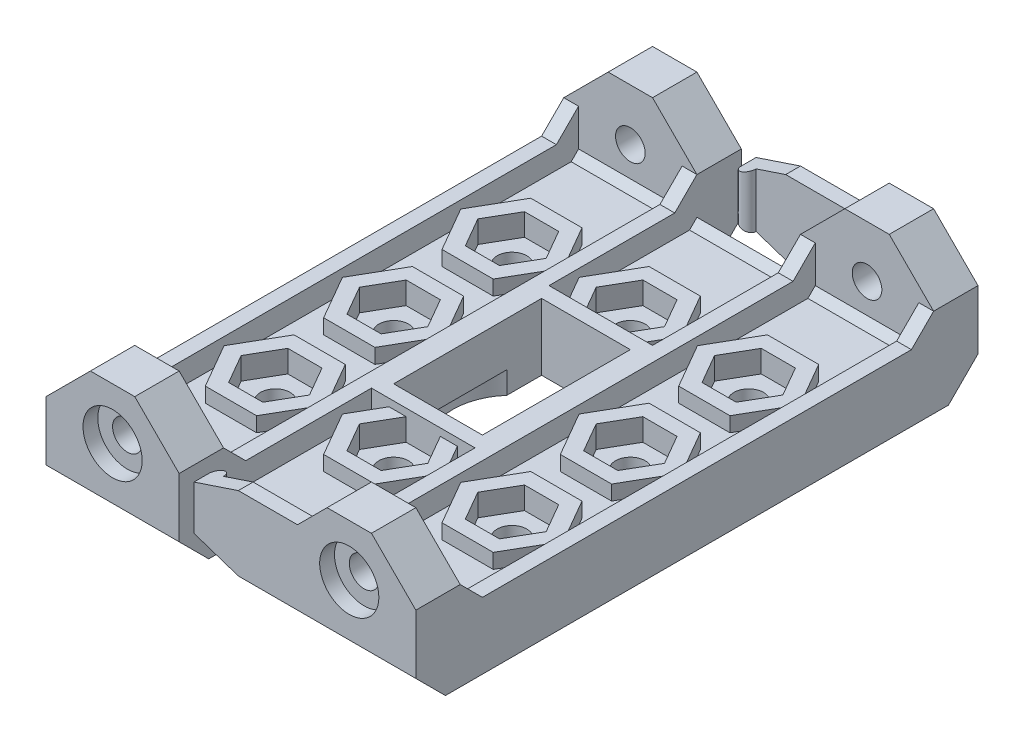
from build123d import *

# Parameters (mm, degrees)
SKETCH1_R                = 1.5
SKETCH1_R_2              = 1
SKETCH1_W                = 6
SKETCH1_H                = 10
EXTRUDE1_DEPTH           = 3
EXTRUDE2_DEPTH           = 4
EXTRUDE3_DEPTH           = 4
SKETCH7_W                = 1
SKETCH7_H                = 38
SKETCH7_W_2              = 6
SKETCH7_H_2              = 10
EXTRUDE4_DEPTH           = 4.5
EXTRUDE5_DEPTH           = 6
SKETCH9_R                = 5.5
SKETCH9_R_2              = 1.5
EXTRUDE10_DEPTH          = 3.5
EXTRUDE11_DEPTH          = 6
EXTRUDE12_DEPTH          = 4
CUT_EXTRUDE1_DEPTH       = 4
CUT_EXTRUDE2_DEPTH       = 4
SKETCH16_R               = 1
EXTRUDE13_DEPTH          = 3
CUT_EXTRUDE4_DEPTH       = 3
CUT_EXTRUDE5_DEPTH       = 32.906112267
CUT_EXTRUDE6_DEPTH       = 2
EXTRUDE14_DEPTH          = 25
EXTRUDE15_DEPTH          = 1
EXTRUDE17_DEPTH          = 1
EXTRUDE18_DEPTH          = 1
EXTRUDE19_DEPTH          = 1
CUT_EXTRUDE7_DEPTH       = 43.121847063
SKETCH26_R               = 2
CUT_EXTRUDE8_DEPTH       = 1
SKETCH27_R               = 4
CUT_EXTRUDE9_DEPTH       = 1.5
SKETCH28_R               = 4
CUT_EXTRUDE10_DEPTH      = 1
CUT_EXTRUDE11_DEPTH      = 1.5
FILLET4_R                = 0.25
CUT_EXTRUDE12_DEPTH      = 1.5
SKETCH31_W               = 16.002833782
SKETCH31_H               = 38
CUT_EXTRUDE13_DEPTH      = 32.906112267
CUT_EXTRUDE14_DEPTH      = 14.5
CUT_EXTRUDE14_DEPTH_BACK = 14.5
EXTRUDE20_DEPTH          = 15
EXTRUDE20_DEPTH_BACK     = 15
EXTRUDE21_DEPTH          = 1
CUT_EXTRUDE15_DEPTH      = 0.5
SKETCH36_R               = 1
CUT_EXTRUDE16_DEPTH      = 10.5


with BuildPart() as part:
    # Sketch1 → Extrude1 (new body)
    with BuildSketch(Plane(origin=(0, 0, 0), x_dir=(1, 0, 0), z_dir=(0, 1, 0))):
        with BuildLine():
            Line((-12.5, -19), (-12.5, -12.75))
            ThreePointArc((-12.5, -12.75), (-13.085786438, -11.335786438), (-14.5, -10.75))
            Line((-14.5, -10.75), (-19, -10.75))
            ThreePointArc((-19, -10.75), (-22.535533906, -9.285533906), (-24, -5.75))
            Line((-24, -5.75), (-24, 5.75))
            ThreePointArc((-24, 5.75), (-22.535533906, 9.285533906), (-19, 10.75))
            Line((-19, 10.75), (-14.5, 10.75))
            ThreePointArc((-14.5, 10.75), (-13.085786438, 11.335786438), (-12.5, 12.75))
            Line((-12.5, 12.75), (-12.5, 19))
            Line((-12.5, 19), (12.5, 19))
            Line((12.5, 19), (12.5, -19))
            Line((12.5, -19), (-12.5, -19))
        make_face()
        with Locations(Location((-14.5, 0, 0), (0, 0, 270))):
            Circle(SKETCH1_R, mode=Mode.SUBTRACT)
        with Locations(Location((0, 8, 0), (0, 0, 270))):
            Circle(SKETCH1_R_2, mode=Mode.SUBTRACT)
        with Locations(Location((8, 0, 0), (0, 0, 270))):
            Circle(SKETCH1_R_2, mode=Mode.SUBTRACT)
        with Locations(Location((0, -8, 0), (0, 0, 270))):
            Circle(SKETCH1_R_2, mode=Mode.SUBTRACT)
        with Locations(Location((-8, 0, 0), (0, 0, 270))):
            Circle(SKETCH1_R_2, mode=Mode.SUBTRACT)
        with Locations(Location((-20.156854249, 5.656854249, 0), (0, 0, 270))):
            Circle(SKETCH1_R_2, mode=Mode.SUBTRACT)
        with Locations(Location((-20.156854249, -5.656854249, 0), (0, 0, 270))):
            Circle(SKETCH1_R_2, mode=Mode.SUBTRACT)
        with Locations(Location((-8.843145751, -5.656854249, 0), (0, 0, 270))):
            Circle(SKETCH1_R_2, mode=Mode.SUBTRACT)
        with Locations(Location((-8.843145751, 5.656854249, 0), (0, 0, 270))):
            Circle(SKETCH1_R_2, mode=Mode.SUBTRACT)
        with Locations(Location((8, 8, 0), (0, 0, 270))):
            Circle(SKETCH1_R_2, mode=Mode.SUBTRACT)
        with Locations(Location((8, -8, 0), (0, 0, 270))):
            Circle(SKETCH1_R_2, mode=Mode.SUBTRACT)
        Rectangle(SKETCH1_W, SKETCH1_H, mode=Mode.SUBTRACT)
    extrude(amount=EXTRUDE1_DEPTH)

    # Sketch2 → Extrude2 (add)
    # profile 1 of 4: a face of its own
    with BuildSketch(Plane(origin=(0, 0, 0), x_dir=(1, 0, 0), z_dir=(0, 1, 0))):
        Polygon((-19.260278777, -2.310789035), (-16.810789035, -4.760278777), (-17.707364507, -8.106343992), (-21.053429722, -9.002919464), (-23.502919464, -6.553429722), (-22.606343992, -3.207364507), align=None)
        Polygon((-19.559663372, -3.426127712), (-17.926258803, -5.058709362), (-18.523413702, -7.289570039), (-20.75397317, -7.887849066), (-22.387377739, -6.255267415), (-21.79022284, -4.024406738), align=None, mode=Mode.SUBTRACT)
    # profile 2 of 4: a face of its own
    with BuildSketch(Plane(origin=(0, 0, 0), x_dir=(1, 0, 0), z_dir=(0, 1, 0))):
        Polygon((-6.393656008, 3.207364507), (-9.739721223, 2.310789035), (-12.189210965, 4.760278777), (-11.292635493, 8.106343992), (-7.946570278, 9.002919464), (-5.497080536, 6.553429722), align=None)
        Polygon((-7.210429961, 4.023413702), (-9.441290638, 3.426258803), (-11.073872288, 5.059663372), (-10.475593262, 7.29022284), (-8.244732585, 7.887377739), (-6.612150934, 6.25397317), align=None, mode=Mode.SUBTRACT)
    # profile 3 of 4: a face of its own
    with BuildSketch(Plane(origin=(0, 0, 0), x_dir=(1, 0, 0), z_dir=(0, 1, 0))):
        Polygon((-16.810789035, 4.760278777), (-19.260278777, 2.310789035), (-22.606343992, 3.207364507), (-23.502919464, 6.553429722), (-21.053429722, 9.002919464), (-17.707364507, 8.106343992), align=None)
        Polygon((-17.926127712, 5.059663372), (-19.558709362, 3.426258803), (-21.789570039, 4.023413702), (-22.387849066, 6.25397317), (-20.755267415, 7.887377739), (-18.524406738, 7.29022284), align=None, mode=Mode.SUBTRACT)
    # profile 4 of 4: a face of its own
    with BuildSketch(Plane(origin=(0, 0, 0), x_dir=(1, 0, 0), z_dir=(0, 1, 0))):
        Polygon((-12.189210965, -4.760278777), (-9.739721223, -2.310789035), (-6.393656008, -3.207364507), (-5.497080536, -6.553429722), (-7.946570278, -9.002919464), (-11.292635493, -8.106343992), align=None)
        Polygon((-11.073872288, -5.059663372), (-9.441290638, -3.426258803), (-7.210429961, -4.023413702), (-6.612150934, -6.25397317), (-8.244732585, -7.887377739), (-10.475593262, -7.29022284), align=None, mode=Mode.SUBTRACT)
    extrude(amount=EXTRUDE2_DEPTH)

    # Sketch5 → Extrude3 (add)
    # profile 1 of 6: a face of its own
    with BuildSketch(Plane(origin=(0, 0, 0), x_dir=(1, 0, 0), z_dir=(0, 1, 0))):
        Polygon((-3.464101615, -8), (-1.732050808, -11), (1.732050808, -11), (3.464101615, -8), (1.732050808, -5), (-1.732050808, -5), align=None)
        Polygon((-2.309401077, -8), (-1.154700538, -10), (1.154700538, -10), (2.309401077, -8), (1.154700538, -6), (-1.154700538, -6), align=None, mode=Mode.SUBTRACT)
    # profile 2 of 6: a face of its own
    with BuildSketch(Plane(origin=(0, 0, 0), x_dir=(1, 0, 0), z_dir=(0, 1, 0))):
        Polygon((-1.732050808, 11), (1.732050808, 11), (3.464101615, 8), (1.732050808, 5), (-1.732050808, 5), (-3.464101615, 8), align=None)
        Polygon((-1.154700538, 10), (1.154700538, 10), (2.309401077, 8), (1.154700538, 6), (-1.154700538, 6), (-2.309401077, 8), align=None, mode=Mode.SUBTRACT)
    # profile 3 of 6: a face of its own
    with BuildSketch(Plane(origin=(0, 0, 0), x_dir=(1, 0, 0), z_dir=(0, 1, 0))):
        Polygon((11.464101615, 8), (9.732050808, 11), (6.267949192, 11), (4.535898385, 8), (6.267949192, 5), (9.732050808, 5), align=None)
        Polygon((10.309401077, 8), (9.154700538, 10), (6.845299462, 10), (5.690598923, 8), (6.845299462, 6), (9.154700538, 6), align=None, mode=Mode.SUBTRACT)
    # profile 4 of 6: a face of its own
    with BuildSketch(Plane(origin=(0, 0, 0), x_dir=(1, 0, 0), z_dir=(0, 1, 0))):
        Polygon((9.732050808, -11), (6.267949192, -11), (4.535898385, -8), (6.267949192, -5), (9.732050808, -5), (11.464101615, -8), align=None)
        Polygon((9.154700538, -10), (6.845299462, -10), (5.690598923, -8), (6.845299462, -6), (9.154700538, -6), (10.309401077, -8), align=None, mode=Mode.SUBTRACT)
    # profile 5 of 6: a face of its own
    with BuildSketch(Plane(origin=(0, 0, 0), x_dir=(1, 0, 0), z_dir=(0, 1, 0))):
        Polygon((9.732050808, -3), (6.267949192, -3), (4.535898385, 0), (6.267949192, 3), (9.732050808, 3), (11.464101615, 0), align=None)
        Polygon((9.154700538, -2), (6.845299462, -2), (5.690598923, 0), (6.845299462, 2), (9.154700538, 2), (10.309401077, 0), align=None, mode=Mode.SUBTRACT)
    # profile 6 of 6: a face of its own
    with BuildSketch(Plane(origin=(0, 0, 0), x_dir=(1, 0, 0), z_dir=(0, 1, 0))):
        Polygon((-11, -1.732050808), (-11, 1.732050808), (-8, 3.464101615), (-5, 1.732050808), (-5, -1.732050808), (-8, -3.464101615), align=None)
        Polygon((-10, -1.154700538), (-10, 1.154700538), (-8, 2.309401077), (-6, 1.154700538), (-6, -1.154700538), (-8, -2.309401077), align=None, mode=Mode.SUBTRACT)
    extrude(amount=EXTRUDE3_DEPTH)

    # Sketch7 → Extrude4 (add)
    # profile 1 of 3: a face of its own
    with BuildSketch(Plane(origin=(0, 0, 0), x_dir=(1, 0, 0), z_dir=(0, 1, 0))):
        with Locations((-12, 0)):
            Rectangle(SKETCH7_W, SKETCH7_H)
    # profile 2 of 3: a face of its own
    with BuildSketch(Plane(origin=(0, 0, 0), x_dir=(1, 0, 0), z_dir=(0, 1, 0))):
        Polygon((-4.5, 19), (-3.5, 19), (-3.5, 6), (3.5, 6), (3.5, 19), (4.5, 19), (4.5, -19), (3.5, -19), (3.5, -6), (-3.5, -6), (-3.5, -19), (-4.5, -19), align=None)
        Rectangle(SKETCH7_W_2, SKETCH7_H_2, mode=Mode.SUBTRACT)
    # profile 3 of 3: a face of its own
    with BuildSketch(Plane(origin=(0, 0, 0), x_dir=(1, 0, 0), z_dir=(0, 1, 0))):
        with Locations((12, 0)):
            Rectangle(SKETCH7_W, SKETCH7_H)
    extrude(amount=EXTRUDE4_DEPTH)

    # Sketch8 → Extrude5 (add)
    with BuildSketch(Plane(origin=(0, 0, 0), x_dir=(1, 0, 0), z_dir=(0, 1, 0))):
        with BuildLine():
            Line((-11.5, -9.748913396), (-11.5, -10.25))
            ThreePointArc((-11.5, -10.25), (-11.646446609, -10.603553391), (-12, -10.75))
            Line((-12, -10.75), (-19, -10.75))
            ThreePointArc((-19, -10.75), (-22.535533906, -9.285533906), (-24, -5.75))
            Line((-24, -5.75), (-24, 5.751086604))
            ThreePointArc((-24, 5.751086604), (-22.535533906, 9.28662051), (-19, 10.751086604))
            Line((-19, 10.751086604), (-12, 10.751086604))
            ThreePointArc((-12, 10.751086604), (-11.646446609, 10.604639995), (-11.5, 10.251086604))
            Line((-11.5, 10.251086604), (-11.5, 9.751086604))
            ThreePointArc((-11.5, 9.751086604), (-11.646446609, 9.397533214), (-12, 9.251086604))
            Line((-12, 9.251086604), (-19, 9.251086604))
            ThreePointArc((-19, 9.251086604), (-21.474873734, 8.225960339), (-22.5, 5.751086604))
            Line((-22.5, 5.751086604), (-22.5, -5.748913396))
            ThreePointArc((-22.5, -5.748913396), (-21.474873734, -8.22378713), (-19, -9.248913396))
            Line((-19, -9.248913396), (-12, -9.248913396))
            ThreePointArc((-12, -9.248913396), (-11.646446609, -9.395360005), (-11.5, -9.748913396))
        make_face()
    extrude(amount=EXTRUDE5_DEPTH)

    # Sketch9 → Extrude10 (add)
    with BuildSketch(Plane(origin=(0, 0, 0), x_dir=(1, 0, 0), z_dir=(0, 1, 0))):
        with Locations((-14.5, 0)):
            Circle(SKETCH9_R)
        with Locations(Location((-14.5, 0, 0), (0, 0, 270))):
            Circle(SKETCH9_R_2, mode=Mode.SUBTRACT)
    extrude(amount=EXTRUDE10_DEPTH)

    # Sketch10 → Extrude11 (add)
    with BuildSketch(Plane(origin=(0, 0, 0), x_dir=(1, 0, 0), z_dir=(0, 1, 0))):
        Polygon((-16.953738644, 4.25), (-12.046261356, 4.25), (-9.592522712, 0), (-12.046261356, -4.25), (-16.953738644, -4.25), (-19.407477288, 0), align=None)
        Polygon((-16.232050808, 3), (-12.767949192, 3), (-11.035898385, 0), (-12.767949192, -3), (-16.232050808, -3), (-17.964101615, 0), align=None, mode=Mode.SUBTRACT)
    extrude(amount=EXTRUDE11_DEPTH)

    # Sketch12 → Extrude12 (add)
    with BuildSketch(Plane(origin=(0, 0, 0), x_dir=(1, 0, 0), z_dir=(0, 1, 0))):
        with BuildLine():
            Line((-11.5, 4.609772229), (-11.5, -4.609772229))
            ThreePointArc((-11.5, -4.609772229), (-9, 0), (-11.5, 4.609772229))
        make_face()
    extrude(amount=EXTRUDE12_DEPTH)

    # Sketch13 → Cut-Extrude1 (cut)
    with BuildSketch(Plane(origin=(0, 3.5, 0), x_dir=(-1, 0, 0), z_dir=(0, 1, 0))):
        Polygon((11.035898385, 0), (12.767949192, 3), (16.232050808, 3), (17.964101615, 0), (16.232050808, -3), (12.767949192, -3), align=None)
    extrude(amount=CUT_EXTRUDE1_DEPTH, mode=Mode.SUBTRACT)

    # Sketch14 → Cut-Extrude2 (cut)
    with BuildSketch(Plane(origin=(0, 3, 0), x_dir=(-1, 0, 0), z_dir=(0, 1, 0))):
        Polygon((8, -2.309401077), (10, -1.154700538), (10, 1.154700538), (8, 2.309401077), align=None)
    extrude(amount=CUT_EXTRUDE2_DEPTH, mode=Mode.SUBTRACT)

    # Sketch16 → Extrude13 (add)
    # profile 1 of 2: a face of its own
    with BuildSketch(Plane.XY.offset(19)):
        Polygon((12.5, 0), (12.5, 6), (9.5, 9), (6.5, 9), (4.5, 7), (0.5, 7), (-2.5, 6), (-2.5, 3), (0.5, 2), (3.5, 2), (3.5, 0), align=None)
        with Locations((8, 5.5)):
            Circle(SKETCH16_R, mode=Mode.SUBTRACT)
    # profile 2 of 2: a face of its own
    with BuildSketch(Plane.XY.offset(19)):
        Polygon((-6.5, 9), (-3.5, 6), (-3.5, 0), (-12.5, 0), (-12.5, 6), (-9.5, 9), align=None)
        with Locations((-8, 5.5)):
            Circle(SKETCH16_R, mode=Mode.SUBTRACT)
    extrude13 = extrude(amount=-EXTRUDE13_DEPTH)

    # Sketch17 → Cut-Extrude4 (cut)
    with BuildSketch(Plane.XY.offset(19)):
        Polygon((-2.5, 3), (0.5, 2), (4.5, 2), (4.5, 0), (-3.5, 0), (-3.5, 3), align=None)
    cut_extrude4 = extrude(amount=-CUT_EXTRUDE4_DEPTH, mode=Mode.SUBTRACT)

    # Sketch18 → Cut-Extrude5 (cut, through all)
    with BuildSketch(Plane(origin=(0, 0, 0), x_dir=(1, 0, 0), z_dir=(0, 1, 0))):
        with BuildLine():
            Line((-2.5, -16), (3.5, -16))
            Line((3.5, -16), (3.5, -18))
            Line((3.5, -18), (-1.5, -18))
            ThreePointArc((-1.5, -18), (-2, -17.5), (-2.5, -18))
            Line((-2.5, -18), (-2.5, -16))
        make_face()
    cut_extrude5 = extrude(amount=CUT_EXTRUDE5_DEPTH, mode=Mode.SUBTRACT)

    # Sketch19 → Cut-Extrude6 (cut)
    with BuildSketch(Plane(origin=(0, 0, 16), x_dir=(-1, 0, 0), z_dir=(0, 0, -1))):
        Polygon((-4.5, 7), (-3.5, 6), (-3.5, 7), align=None)
    cut_extrude6 = extrude(amount=-CUT_EXTRUDE6_DEPTH, mode=Mode.SUBTRACT)

    # Sketch20 → Extrude14 (add)
    with BuildSketch(Plane(origin=(12.5, 0, 0), x_dir=(0, 0, -1), z_dir=(1, 0, 0))):
        Polygon((-16, 3), (-15.5, 3), (-16, 3.5), align=None)
    extrude14 = extrude(amount=-EXTRUDE14_DEPTH)

    # Sketch21 → Extrude15 (add)
    with BuildSketch(Plane(origin=(12.5, 0, 0), x_dir=(0, 0, -1), z_dir=(1, 0, 0))):
        Polygon((-16, 6), (-14.5, 4.5), (-16, 4.5), align=None)
    extrude15 = extrude(amount=-EXTRUDE15_DEPTH)

    # Sketch22 → Extrude17 (add)
    with BuildSketch(Plane(origin=(4.5, 0, 0), x_dir=(0, 0, -1), z_dir=(1, 0, 0))):
        Polygon((-16, 6), (-14.5, 4.5), (-16, 4.5), align=None)
    extrude17 = extrude(amount=-EXTRUDE17_DEPTH)

    # Sketch23 → Extrude18 (add)
    with BuildSketch(Plane(origin=(-3.5, 0, 0), x_dir=(0, 0, -1), z_dir=(1, 0, 0))):
        Polygon((-16, 6), (-14.5, 4.5), (-16, 4.5), align=None)
    extrude18 = extrude(amount=-EXTRUDE18_DEPTH)

    # Sketch24 → Extrude19 (add)
    with BuildSketch(Plane(origin=(-11.5, 0, 0), x_dir=(0, 0, -1), z_dir=(1, 0, 0))):
        Polygon((-16, 6), (-14.5, 4.5), (-16, 4.5), align=None)
    extrude19 = extrude(amount=-EXTRUDE19_DEPTH)

    # Sketch25 → Cut-Extrude7 (cut, through all)
    with BuildSketch(Plane(origin=(12.5, 0, 0), x_dir=(0, 0, -1), z_dir=(1, 0, 0))):
        Polygon((-19, 0), (-17, 0), (-19, 2), align=None)
    cut_extrude7 = extrude(amount=-CUT_EXTRUDE7_DEPTH, mode=Mode.SUBTRACT)

    # Sketch26 → Cut-Extrude8 (cut)
    with BuildSketch(Plane.XY.offset(19)):
        with Locations((-8, 5.5)):
            Circle(SKETCH26_R)
        with Locations((8, 5.5)):
            Circle(SKETCH26_R)
    cut_extrude8 = extrude(amount=-CUT_EXTRUDE8_DEPTH, mode=Mode.SUBTRACT)

    # Mirror1: Extrude13, Cut-Extrude4, Cut-Extrude5, Cut-Extrude6, Extrude14, Extrude15, Extrude17, Extrude18, Extrude19, Cut-Extrude7, Cut-Extrude8 across plane
    add(extrude13.mirror(Plane.XY))
    add(cut_extrude4.mirror(Plane.XY), mode=Mode.SUBTRACT)
    add(cut_extrude5.mirror(Plane.XY), mode=Mode.SUBTRACT)
    add(cut_extrude6.mirror(Plane.XY), mode=Mode.SUBTRACT)
    add(extrude14.mirror(Plane.XY))
    add(extrude15.mirror(Plane.XY))
    add(extrude17.mirror(Plane.XY))
    add(extrude18.mirror(Plane.XY))
    add(extrude19.mirror(Plane.XY))
    add(cut_extrude7.mirror(Plane.XY), mode=Mode.SUBTRACT)
    add(cut_extrude8.mirror(Plane.XY), mode=Mode.SUBTRACT)

    # Sketch27 → Cut-Extrude9 (cut)
    with BuildSketch(Plane.XZ):
        Circle(SKETCH27_R)
    extrude(amount=-CUT_EXTRUDE9_DEPTH, mode=Mode.SUBTRACT)

    # Sketch28 → Cut-Extrude10 (cut)
    with BuildSketch(Plane.XZ):
        with Locations(Location((-14.5, 0, 0), (0, 0, 270))):
            Circle(SKETCH28_R)
    extrude(amount=-CUT_EXTRUDE10_DEPTH, mode=Mode.SUBTRACT)

    # Sketch29 → Cut-Extrude11 (cut)
    with BuildSketch(Plane.ZY.offset(24)):
        with BuildLine():
            Line((-2.500543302, 6), (2.499456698, 6))
            ThreePointArc((2.499456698, 6), (1.91367026, 4.585786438), (0.499456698, 4))
            Line((0.499456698, 4), (-0.500543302, 4))
            ThreePointArc((-0.500543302, 4), (-1.914756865, 4.585786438), (-2.500543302, 6))
        make_face()
    extrude(amount=-CUT_EXTRUDE11_DEPTH, mode=Mode.SUBTRACT)

    # Fillet4
    fillet4_edges = [part.edges().sort_by_distance(p)[0] for p in [
        (-11.023130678, 6, -2.477885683),
        (-10, 6, 0),
        (-14.5, 6, -4.25),
        (-18.180607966, 6, -2.125),
        (-18.180607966, 6, 2.125),
        (-14.5, 6, 4.25),
        (-11.023130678, 6, 2.477885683),
        (-17.098076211, 6, -1.5),
        (-17.098076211, 6, 1.5),
        (-14.5, 6, 3),
        (-11.901923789, 6, 1.5),
        (-11.901923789, 6, -1.5),
        (-14.5, 6, -3),
    ]]
    fillet(fillet4_edges, radius=FILLET4_R)

    # Sketch30 → Cut-Extrude12 (cut)
    with BuildSketch(Plane(origin=(0, 3.5, 0), x_dir=(-1, 0, 0), z_dir=(0, 1, 0))):
        Polygon((16.232050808, -3), (12.767949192, -3), (11.035898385, 0), (12.767949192, 3), (16.232050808, 3), (17.964101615, 0), align=None)
    extrude(amount=-CUT_EXTRUDE12_DEPTH, mode=Mode.SUBTRACT)

    # Sketch31 → Cut-Extrude13 (cut, through all)
    with BuildSketch(Plane.XZ):
        with Locations((-20.501416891, 0)):
            Rectangle(SKETCH31_W, SKETCH31_H)
    extrude(amount=-CUT_EXTRUDE13_DEPTH, mode=Mode.SUBTRACT)

    # Sketch32 → Cut-Extrude14 (cut, two sides: drawn at the far end of the back side and taken through both)
    with BuildSketch(Plane(origin=(0, 0, 0), x_dir=(-1, 0, 0), z_dir=(0, 0, -1)).offset(-CUT_EXTRUDE14_DEPTH_BACK)):
        Polygon((12.837931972, 9.642365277), (4.5, 4.5), (4.5, 3), (11.5, 3), (11.5, 4.5), (12.837931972, 4.5), align=None)
    extrude(amount=CUT_EXTRUDE14_DEPTH + CUT_EXTRUDE14_DEPTH_BACK, mode=Mode.SUBTRACT)

    # Sketch33 → Extrude20 (add, two sides: drawn at the far end of the back side and taken through both)
    with BuildSketch(Plane.XY.offset(-EXTRUDE20_DEPTH_BACK)):
        Polygon((-4.5, 0), (-12.5, 0), (-12.5, 4.5), (-11.5, 4.5), (-11.5, 3), (-4.5, 3), align=None)
    extrude(amount=EXTRUDE20_DEPTH + EXTRUDE20_DEPTH_BACK)

    # Sketch34 → Extrude21 (add)
    # profile 1 of 3: a face of its own
    with BuildSketch(Plane(origin=(0, 3, 0), x_dir=(-1, 0, 0), z_dir=(0, 1, 0))):
        Polygon((6.267949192, 5), (4.535898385, 8), (6.267949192, 11), (9.732050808, 11), (11.464101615, 8), (9.732050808, 5), align=None)
        Polygon((6.845299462, 6), (5.690598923, 8), (6.845299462, 10), (9.154700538, 10), (10.309401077, 8), (9.154700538, 6), align=None, mode=Mode.SUBTRACT)
    # profile 2 of 3: a face of its own
    with BuildSketch(Plane(origin=(0, 3, 0), x_dir=(-1, 0, 0), z_dir=(0, 1, 0))):
        Polygon((6.267949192, -3), (4.535898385, 0), (6.267949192, 3), (9.732050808, 3), (11.464101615, 0), (9.732050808, -3), align=None)
        Polygon((6.845299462, -2), (5.690598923, 0), (6.845299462, 2), (9.154700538, 2), (10.309401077, 0), (9.154700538, -2), align=None, mode=Mode.SUBTRACT)
    # profile 3 of 3: a face of its own
    with BuildSketch(Plane(origin=(0, 3, 0), x_dir=(-1, 0, 0), z_dir=(0, 1, 0))):
        Polygon((6.267949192, -11), (4.535898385, -8), (6.267949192, -5), (9.732050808, -5), (11.464101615, -8), (9.732050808, -11), align=None)
        Polygon((6.845299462, -10), (5.690598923, -8), (6.845299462, -6), (9.154700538, -6), (10.309401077, -8), (9.154700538, -10), align=None, mode=Mode.SUBTRACT)
    extrude(amount=EXTRUDE21_DEPTH)

    # Sketch35 → Cut-Extrude15 (cut)
    with BuildSketch(Plane(origin=(0, 3, 0), x_dir=(-1, 0, 0), z_dir=(0, 1, 0))):
        Polygon((10.309401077, -8), (9.154700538, -6), (6.845299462, -6), (5.690598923, -8), (6.845299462, -10), (9.154700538, -10), align=None)
        Polygon((10.309401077, 0), (9.154700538, 2), (6.845299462, 2), (5.690598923, 0), (6.845299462, -2), (9.154700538, -2), align=None)
        Polygon((-2.309401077, -8), (-1.154700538, -6), (1.154700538, -6), (2.309401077, -8), (1.154700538, -10), (-1.154700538, -10), align=None)
        Polygon((10.309401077, 8), (9.154700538, 10), (6.845299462, 10), (5.690598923, 8), (6.845299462, 6), (9.154700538, 6), align=None)
        Polygon((-1.154700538, 6), (1.154700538, 6), (2.309401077, 8), (1.154700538, 10), (-1.154700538, 10), (-2.309401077, 8), align=None)
        Polygon((-5.690598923, 0), (-6.845299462, -2), (-9.154700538, -2), (-10.309401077, 0), (-9.154700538, 2), (-6.845299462, 2), align=None)
        Polygon((-9.154700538, 6), (-10.309401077, 8), (-9.154700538, 10), (-6.845299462, 10), (-5.690598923, 8), (-6.845299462, 6), align=None)
        Polygon((-9.154700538, -10), (-10.309401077, -8), (-9.154700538, -6), (-6.845299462, -6), (-5.690598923, -8), (-6.845299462, -10), align=None)
    extrude(amount=-CUT_EXTRUDE15_DEPTH, mode=Mode.SUBTRACT)

    # Sketch36 → Cut-Extrude16 (cut)
    with BuildSketch(Plane.XZ):
        with Locations(Location((-8, 8, 0), (0, 0, 270))):
            Circle(SKETCH36_R)
        with Locations(Location((-8, 0, 0), (0, 0, 270))):
            Circle(SKETCH36_R)
        with Locations(Location((-8, -8, 0), (0, 0, 270))):
            Circle(SKETCH36_R)
    extrude(amount=-CUT_EXTRUDE16_DEPTH, mode=Mode.SUBTRACT)


solid = part.part
